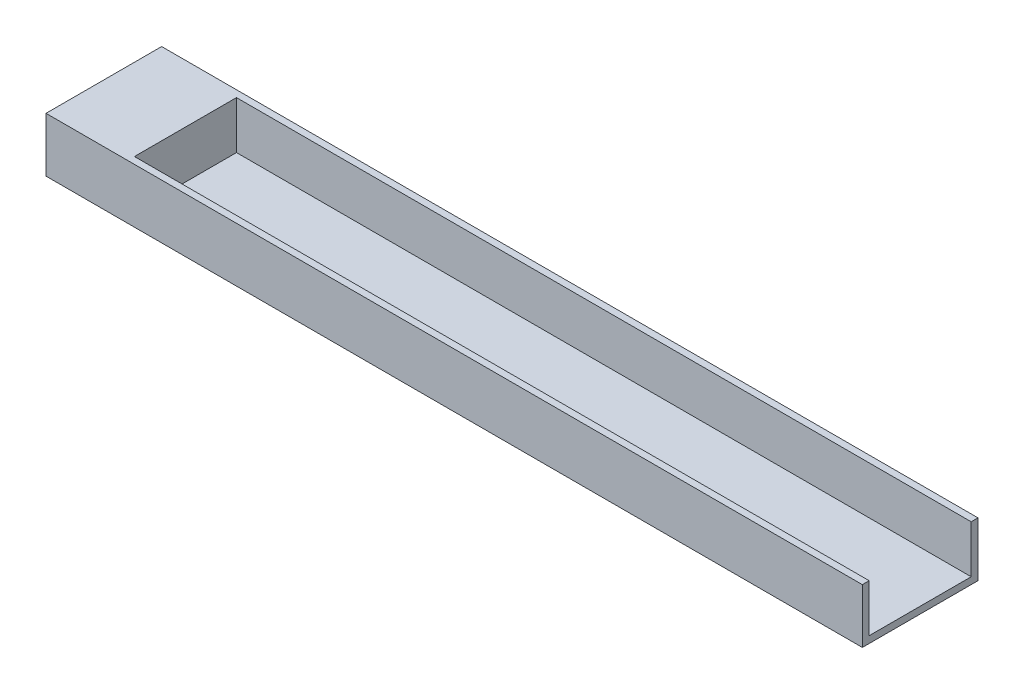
ISO-10303-21;
HEADER;
FILE_DESCRIPTION(('STEP AP214'),'2;1');
FILE_NAME('part.step','',(''),(''),'','','');
FILE_SCHEMA(('AUTOMOTIVE_DESIGN { 1 0 10303 214 1 1 1 1 }'));
ENDSEC;
DATA;
#1=APPLICATION_CONTEXT('core data for automotive mechanical design processes');
#2=APPLICATION_PROTOCOL_DEFINITION('international standard','automotive_design',2000,#1);
#3=PRODUCT_CONTEXT('',#1,'mechanical');
#4=PRODUCT('Part','Part','',(#3));
#5=PRODUCT_RELATED_PRODUCT_CATEGORY('part','',(#4));
#6=PRODUCT_DEFINITION_FORMATION('','',#4);
#7=PRODUCT_DEFINITION_CONTEXT('part definition',#1,'design');
#8=PRODUCT_DEFINITION('design','',#6,#7);
#9=PRODUCT_DEFINITION_SHAPE('','',#8);
#10=(LENGTH_UNIT() NAMED_UNIT(*) SI_UNIT(.MILLI.,.METRE.));
#11=(NAMED_UNIT(*) PLANE_ANGLE_UNIT() SI_UNIT($,.RADIAN.));
#12=(NAMED_UNIT(*) SI_UNIT($,.STERADIAN.) SOLID_ANGLE_UNIT());
#13=UNCERTAINTY_MEASURE_WITH_UNIT(LENGTH_MEASURE(1.E-05),#10,'distance_accuracy_value','');
#14=(GEOMETRIC_REPRESENTATION_CONTEXT(3) GLOBAL_UNCERTAINTY_ASSIGNED_CONTEXT((#13)) GLOBAL_UNIT_ASSIGNED_CONTEXT((#10,
#11,#12)) REPRESENTATION_CONTEXT('',''));
#15=CARTESIAN_POINT('',(0.,0.,0.));
#16=DIRECTION('',(0.,0.,1.));
#17=DIRECTION('',(1.,0.,0.));
#18=AXIS2_PLACEMENT_3D('',#15,#16,#17);
#19=CARTESIAN_POINT('',(0.,50.8,0.));
#20=DIRECTION('',(1.,0.,0.));
#21=DIRECTION('',(0.,0.,-1.));
#22=AXIS2_PLACEMENT_3D('',#19,#20,#21);
#23=PLANE('',#22);
#24=DIRECTION('',(0.,0.,1.));
#25=VECTOR('',#24,1.);
#26=CARTESIAN_POINT('',(0.,0.,0.));
#27=LINE('',#26,#25);
#28=CARTESIAN_POINT('',(-1.11022302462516E-13,0.,-107.95));
#29=VERTEX_POINT('',#28);
#30=CARTESIAN_POINT('',(0.,0.,0.));
#31=VERTEX_POINT('',#30);
#32=EDGE_CURVE('E136',#29,#31,#27,.T.);
#33=ORIENTED_EDGE('',*,*,#32,.T.);
#34=DIRECTION('',(0.,-1.,0.));
#35=VECTOR('',#34,1.);
#36=CARTESIAN_POINT('',(0.,50.8,0.));
#37=LINE('',#36,#35);
#38=CARTESIAN_POINT('',(0.,50.8,0.));
#39=VERTEX_POINT('',#38);
#40=EDGE_CURVE('E11',#39,#31,#37,.T.);
#41=ORIENTED_EDGE('',*,*,#40,.F.);
#42=DIRECTION('',(0.,0.,1.));
#43=VECTOR('',#42,1.);
#44=CARTESIAN_POINT('',(0.,50.8,0.));
#45=LINE('',#44,#43);
#46=CARTESIAN_POINT('',(-1.11022302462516E-13,50.8,-107.95));
#47=VERTEX_POINT('',#46);
#48=EDGE_CURVE('E141',#47,#39,#45,.T.);
#49=ORIENTED_EDGE('',*,*,#48,.F.);
#50=DIRECTION('',(0.,-1.,0.));
#51=VECTOR('',#50,1.);
#52=CARTESIAN_POINT('',(-1.11022302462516E-13,50.8,-107.95));
#53=LINE('',#52,#51);
#54=EDGE_CURVE('E149',#47,#29,#53,.T.);
#55=ORIENTED_EDGE('',*,*,#54,.T.);
#56=EDGE_LOOP('',(#33,#41,#49,#55));
#57=FACE_BOUND('',#56,.T.);
#58=ADVANCED_FACE('F32',(#57),#23,.F.);
#59=CARTESIAN_POINT('',(0.,50.8,0.));
#60=DIRECTION('',(0.,0.,-1.));
#61=DIRECTION('',(-1.,0.,0.));
#62=AXIS2_PLACEMENT_3D('',#59,#60,#61);
#63=PLANE('',#62);
#64=DIRECTION('',(1.,0.,0.));
#65=VECTOR('',#64,1.);
#66=CARTESIAN_POINT('',(0.,0.,0.));
#67=LINE('',#66,#65);
#68=CARTESIAN_POINT('',(762.,0.,0.));
#69=VERTEX_POINT('',#68);
#70=EDGE_CURVE('E152',#31,#69,#67,.T.);
#71=ORIENTED_EDGE('',*,*,#70,.T.);
#72=DIRECTION('',(0.,-1.,0.));
#73=VECTOR('',#72,1.);
#74=CARTESIAN_POINT('',(762.,50.8,0.));
#75=LINE('',#74,#73);
#76=CARTESIAN_POINT('',(762.,50.8,0.));
#77=VERTEX_POINT('',#76);
#78=EDGE_CURVE('E39',#77,#69,#75,.T.);
#79=ORIENTED_EDGE('',*,*,#78,.F.);
#80=DIRECTION('',(1.,0.,0.));
#81=VECTOR('',#80,1.);
#82=CARTESIAN_POINT('',(0.,50.8,0.));
#83=LINE('',#82,#81);
#84=EDGE_CURVE('E83',#39,#77,#83,.T.);
#85=ORIENTED_EDGE('',*,*,#84,.F.);
#86=ORIENTED_EDGE('',*,*,#40,.T.);
#87=EDGE_LOOP('',(#71,#79,#85,#86));
#88=FACE_BOUND('',#87,.T.);
#89=ADVANCED_FACE('F187',(#88),#63,.F.);
#90=CARTESIAN_POINT('',(762.,50.8,0.));
#91=DIRECTION('',(-1.,0.,0.));
#92=DIRECTION('',(0.,0.,1.));
#93=AXIS2_PLACEMENT_3D('',#90,#91,#92);
#94=PLANE('',#93);
#95=DIRECTION('',(0.,0.,-1.));
#96=VECTOR('',#95,1.);
#97=CARTESIAN_POINT('',(762.,6.35,-6.35));
#98=LINE('',#97,#96);
#99=CARTESIAN_POINT('',(762.,6.35,-6.35));
#100=VERTEX_POINT('',#99);
#101=CARTESIAN_POINT('',(762.,6.35,-101.6));
#102=VERTEX_POINT('',#101);
#103=EDGE_CURVE('E127',#100,#102,#98,.T.);
#104=ORIENTED_EDGE('',*,*,#103,.F.);
#105=DIRECTION('',(0.,-1.,0.));
#106=VECTOR('',#105,1.);
#107=CARTESIAN_POINT('',(762.,50.8,-6.35));
#108=LINE('',#107,#106);
#109=CARTESIAN_POINT('',(762.,50.8,-6.35));
#110=VERTEX_POINT('',#109);
#111=EDGE_CURVE('E112',#110,#100,#108,.T.);
#112=ORIENTED_EDGE('',*,*,#111,.F.);
#113=DIRECTION('',(0.,0.,-1.));
#114=VECTOR('',#113,1.);
#115=CARTESIAN_POINT('',(762.,50.8,0.));
#116=LINE('',#115,#114);
#117=EDGE_CURVE('E145',#77,#110,#116,.T.);
#118=ORIENTED_EDGE('',*,*,#117,.F.);
#119=ORIENTED_EDGE('',*,*,#78,.T.);
#120=DIRECTION('',(0.,0.,-1.));
#121=VECTOR('',#120,1.);
#122=CARTESIAN_POINT('',(762.,0.,0.));
#123=LINE('',#122,#121);
#124=CARTESIAN_POINT('',(762.,0.,-107.95));
#125=VERTEX_POINT('',#124);
#126=EDGE_CURVE('E154',#69,#125,#123,.T.);
#127=ORIENTED_EDGE('',*,*,#126,.T.);
#128=DIRECTION('',(0.,-1.,0.));
#129=VECTOR('',#128,1.);
#130=CARTESIAN_POINT('',(762.,50.8,-107.95));
#131=LINE('',#130,#129);
#132=CARTESIAN_POINT('',(762.,50.8,-107.95));
#133=VERTEX_POINT('',#132);
#134=EDGE_CURVE('E158',#133,#125,#131,.T.);
#135=ORIENTED_EDGE('',*,*,#134,.F.);
#136=CARTESIAN_POINT('',(762.,50.8,-101.6));
#137=VERTEX_POINT('',#136);
#138=EDGE_CURVE('E144',#137,#133,#116,.T.);
#139=ORIENTED_EDGE('',*,*,#138,.F.);
#140=DIRECTION('',(0.,1.,0.));
#141=VECTOR('',#140,1.);
#142=CARTESIAN_POINT('',(762.,50.8,-101.6));
#143=LINE('',#142,#141);
#144=EDGE_CURVE('E125',#102,#137,#143,.T.);
#145=ORIENTED_EDGE('',*,*,#144,.F.);
#146=EDGE_LOOP('',(#104,#112,#118,#119,#127,#135,#139,#145));
#147=FACE_BOUND('',#146,.T.);
#148=ADVANCED_FACE('F163',(#147),#94,.F.);
#149=CARTESIAN_POINT('',(-1.11022302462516E-13,50.8,-107.95));
#150=DIRECTION('',(0.,0.,1.));
#151=DIRECTION('',(1.,0.,0.));
#152=AXIS2_PLACEMENT_3D('',#149,#150,#151);
#153=PLANE('',#152);
#154=DIRECTION('',(-1.,0.,0.));
#155=VECTOR('',#154,1.);
#156=CARTESIAN_POINT('',(-1.11022302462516E-13,0.,-107.95));
#157=LINE('',#156,#155);
#158=EDGE_CURVE('E76',#125,#29,#157,.T.);
#159=ORIENTED_EDGE('',*,*,#158,.T.);
#160=ORIENTED_EDGE('',*,*,#54,.F.);
#161=DIRECTION('',(-1.,0.,0.));
#162=VECTOR('',#161,1.);
#163=CARTESIAN_POINT('',(-1.11022302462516E-13,50.8,-107.95));
#164=LINE('',#163,#162);
#165=EDGE_CURVE('E55',#133,#47,#164,.T.);
#166=ORIENTED_EDGE('',*,*,#165,.F.);
#167=ORIENTED_EDGE('',*,*,#134,.T.);
#168=EDGE_LOOP('',(#159,#160,#166,#167));
#169=FACE_BOUND('',#168,.T.);
#170=ADVANCED_FACE('F171',(#169),#153,.F.);
#171=CARTESIAN_POINT('',(0.,50.8,0.));
#172=DIRECTION('',(0.,-1.,0.));
#173=DIRECTION('',(0.,0.,-1.));
#174=AXIS2_PLACEMENT_3D('',#171,#172,#173);
#175=PLANE('',#174);
#176=ORIENTED_EDGE('',*,*,#117,.T.);
#177=DIRECTION('',(1.,0.,0.));
#178=VECTOR('',#177,1.);
#179=CARTESIAN_POINT('',(76.1999999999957,50.8,-6.34999999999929));
#180=LINE('',#179,#178);
#181=CARTESIAN_POINT('',(76.1999999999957,50.8,-6.34999999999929));
#182=VERTEX_POINT('',#181);
#183=EDGE_CURVE('E134',#182,#110,#180,.T.);
#184=ORIENTED_EDGE('',*,*,#183,.F.);
#185=DIRECTION('',(0.,0.,1.));
#186=VECTOR('',#185,1.);
#187=CARTESIAN_POINT('',(76.1999999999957,50.8,-6.34999999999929));
#188=LINE('',#187,#186);
#189=CARTESIAN_POINT('',(76.1999999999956,50.8,-101.599999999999));
#190=VERTEX_POINT('',#189);
#191=EDGE_CURVE('E117',#190,#182,#188,.T.);
#192=ORIENTED_EDGE('',*,*,#191,.F.);
#193=DIRECTION('',(1.,0.,0.));
#194=VECTOR('',#193,1.);
#195=CARTESIAN_POINT('',(76.1999999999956,50.8,-101.599999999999));
#196=LINE('',#195,#194);
#197=EDGE_CURVE('E137',#190,#137,#196,.T.);
#198=ORIENTED_EDGE('',*,*,#197,.T.);
#199=ORIENTED_EDGE('',*,*,#138,.T.);
#200=ORIENTED_EDGE('',*,*,#165,.T.);
#201=ORIENTED_EDGE('',*,*,#48,.T.);
#202=ORIENTED_EDGE('',*,*,#84,.T.);
#203=EDGE_LOOP('',(#176,#184,#192,#198,#199,#200,#201,#202));
#204=FACE_BOUND('',#203,.T.);
#205=ADVANCED_FACE('F174',(#204),#175,.F.);
#206=CARTESIAN_POINT('',(0.,0.,0.));
#207=DIRECTION('',(0.,-1.,0.));
#208=DIRECTION('',(0.,0.,-1.));
#209=AXIS2_PLACEMENT_3D('',#206,#207,#208);
#210=PLANE('',#209);
#211=ORIENTED_EDGE('',*,*,#32,.F.);
#212=ORIENTED_EDGE('',*,*,#158,.F.);
#213=ORIENTED_EDGE('',*,*,#126,.F.);
#214=ORIENTED_EDGE('',*,*,#70,.F.);
#215=EDGE_LOOP('',(#211,#212,#213,#214));
#216=FACE_BOUND('',#215,.T.);
#217=ADVANCED_FACE('F167',(#216),#210,.T.);
#218=CARTESIAN_POINT('',(76.1999999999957,50.8,-6.34999999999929));
#219=DIRECTION('',(0.,0.,1.));
#220=DIRECTION('',(1.,0.,0.));
#221=AXIS2_PLACEMENT_3D('',#218,#219,#220);
#222=PLANE('',#221);
#223=ORIENTED_EDGE('',*,*,#111,.T.);
#224=DIRECTION('',(1.,0.,0.));
#225=VECTOR('',#224,1.);
#226=CARTESIAN_POINT('',(76.1999999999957,6.35,-6.3499999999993));
#227=LINE('',#226,#225);
#228=CARTESIAN_POINT('',(76.1999999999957,6.35,-6.3499999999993));
#229=VERTEX_POINT('',#228);
#230=EDGE_CURVE('E106',#229,#100,#227,.T.);
#231=ORIENTED_EDGE('',*,*,#230,.F.);
#232=DIRECTION('',(0.,-1.,0.));
#233=VECTOR('',#232,1.);
#234=CARTESIAN_POINT('',(76.1999999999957,50.8,-6.34999999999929));
#235=LINE('',#234,#233);
#236=EDGE_CURVE('E110',#182,#229,#235,.T.);
#237=ORIENTED_EDGE('',*,*,#236,.F.);
#238=ORIENTED_EDGE('',*,*,#183,.T.);
#239=EDGE_LOOP('',(#223,#231,#237,#238));
#240=FACE_BOUND('',#239,.T.);
#241=ADVANCED_FACE('F108',(#240),#222,.F.);
#242=CARTESIAN_POINT('',(76.1999999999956,50.8,-101.599999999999));
#243=DIRECTION('',(0.,0.,-1.));
#244=DIRECTION('',(-1.,0.,0.));
#245=AXIS2_PLACEMENT_3D('',#242,#243,#244);
#246=PLANE('',#245);
#247=ORIENTED_EDGE('',*,*,#144,.T.);
#248=ORIENTED_EDGE('',*,*,#197,.F.);
#249=DIRECTION('',(0.,1.,0.));
#250=VECTOR('',#249,1.);
#251=CARTESIAN_POINT('',(76.1999999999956,50.8,-101.599999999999));
#252=LINE('',#251,#250);
#253=CARTESIAN_POINT('',(76.1999999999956,6.35,-101.599999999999));
#254=VERTEX_POINT('',#253);
#255=EDGE_CURVE('E46',#254,#190,#252,.T.);
#256=ORIENTED_EDGE('',*,*,#255,.F.);
#257=DIRECTION('',(1.,0.,0.));
#258=VECTOR('',#257,1.);
#259=CARTESIAN_POINT('',(76.1999999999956,6.35,-101.599999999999));
#260=LINE('',#259,#258);
#261=EDGE_CURVE('E116',#254,#102,#260,.T.);
#262=ORIENTED_EDGE('',*,*,#261,.T.);
#263=EDGE_LOOP('',(#247,#248,#256,#262));
#264=FACE_BOUND('',#263,.T.);
#265=ADVANCED_FACE('F176',(#264),#246,.F.);
#266=CARTESIAN_POINT('',(76.1999999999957,6.35,-6.3499999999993));
#267=DIRECTION('',(0.,-1.,0.));
#268=DIRECTION('',(0.,0.,-1.));
#269=AXIS2_PLACEMENT_3D('',#266,#267,#268);
#270=PLANE('',#269);
#271=ORIENTED_EDGE('',*,*,#103,.T.);
#272=ORIENTED_EDGE('',*,*,#261,.F.);
#273=DIRECTION('',(0.,0.,-1.));
#274=VECTOR('',#273,1.);
#275=CARTESIAN_POINT('',(76.1999999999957,6.35,-6.3499999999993));
#276=LINE('',#275,#274);
#277=EDGE_CURVE('E119',#229,#254,#276,.T.);
#278=ORIENTED_EDGE('',*,*,#277,.F.);
#279=ORIENTED_EDGE('',*,*,#230,.T.);
#280=EDGE_LOOP('',(#271,#272,#278,#279));
#281=FACE_BOUND('',#280,.T.);
#282=ADVANCED_FACE('F120',(#281),#270,.F.);
#283=CARTESIAN_POINT('',(76.1999999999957,0.,-1.82860262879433E-13));
#284=DIRECTION('',(1.,0.,0.));
#285=DIRECTION('',(0.,0.,-1.));
#286=AXIS2_PLACEMENT_3D('',#283,#284,#285);
#287=PLANE('',#286);
#288=ORIENTED_EDGE('',*,*,#236,.T.);
#289=ORIENTED_EDGE('',*,*,#277,.T.);
#290=ORIENTED_EDGE('',*,*,#255,.T.);
#291=ORIENTED_EDGE('',*,*,#191,.T.);
#292=EDGE_LOOP('',(#288,#289,#290,#291));
#293=FACE_BOUND('',#292,.T.);
#294=ADVANCED_FACE('F122',(#293),#287,.T.);
#295=CLOSED_SHELL('',(#58,#89,#148,#170,#205,#217,#241,#265,#282,#294));
#296=MANIFOLD_SOLID_BREP('B2',#295);
#297=ADVANCED_BREP_SHAPE_REPRESENTATION('',(#18,#296),#14);
#298=SHAPE_DEFINITION_REPRESENTATION(#9,#297);
ENDSEC;
END-ISO-10303-21;
